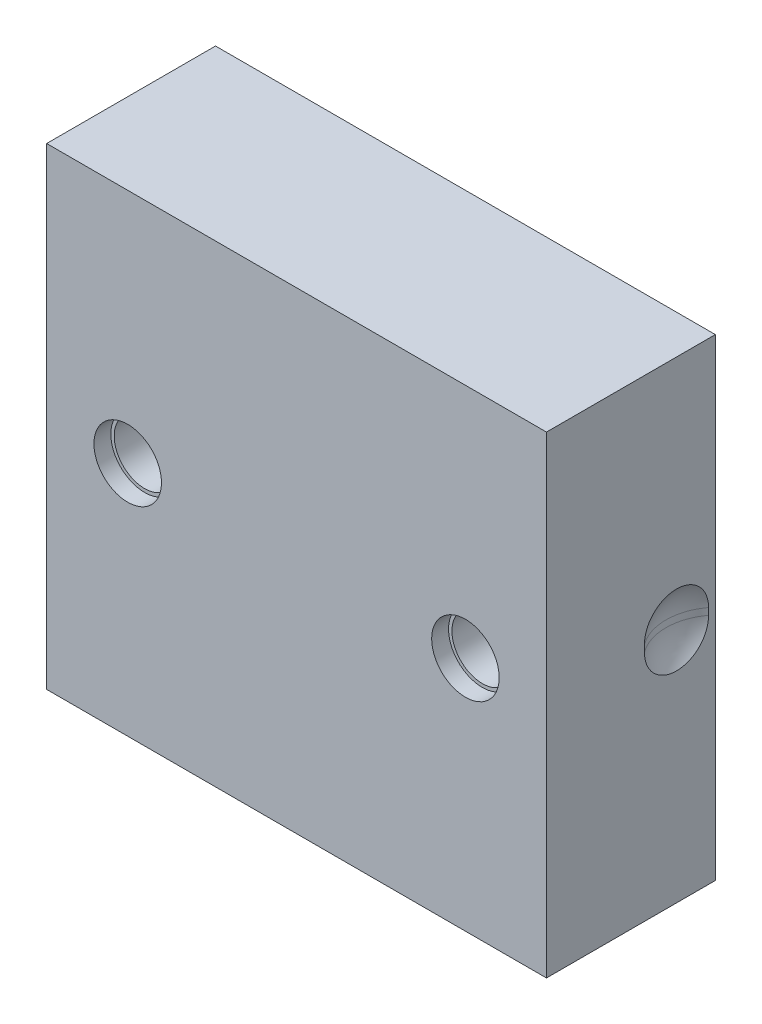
ISO-10303-21;
HEADER;
FILE_DESCRIPTION(('STEP AP214'),'2;1');
FILE_NAME('part.step','',(''),(''),'','','');
FILE_SCHEMA(('AUTOMOTIVE_DESIGN { 1 0 10303 214 1 1 1 1 }'));
ENDSEC;
DATA;
#1=APPLICATION_CONTEXT('core data for automotive mechanical design processes');
#2=APPLICATION_PROTOCOL_DEFINITION('international standard','automotive_design',2000,#1);
#3=PRODUCT_CONTEXT('',#1,'mechanical');
#4=PRODUCT('Part','Part','',(#3));
#5=PRODUCT_RELATED_PRODUCT_CATEGORY('part','',(#4));
#6=PRODUCT_DEFINITION_FORMATION('','',#4);
#7=PRODUCT_DEFINITION_CONTEXT('part definition',#1,'design');
#8=PRODUCT_DEFINITION('design','',#6,#7);
#9=PRODUCT_DEFINITION_SHAPE('','',#8);
#10=(LENGTH_UNIT() NAMED_UNIT(*) SI_UNIT(.MILLI.,.METRE.));
#11=(NAMED_UNIT(*) PLANE_ANGLE_UNIT() SI_UNIT($,.RADIAN.));
#12=(NAMED_UNIT(*) SI_UNIT($,.STERADIAN.) SOLID_ANGLE_UNIT());
#13=UNCERTAINTY_MEASURE_WITH_UNIT(LENGTH_MEASURE(1.E-05),#10,'distance_accuracy_value','');
#14=(GEOMETRIC_REPRESENTATION_CONTEXT(3) GLOBAL_UNCERTAINTY_ASSIGNED_CONTEXT((#13)) GLOBAL_UNIT_ASSIGNED_CONTEXT((#10,
#11,#12)) REPRESENTATION_CONTEXT('',''));
#15=CARTESIAN_POINT('',(0.,0.,0.));
#16=DIRECTION('',(0.,0.,1.));
#17=DIRECTION('',(1.,0.,0.));
#18=AXIS2_PLACEMENT_3D('',#15,#16,#17);
#19=CARTESIAN_POINT('',(-74.5004119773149,24.9995880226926,99.5));
#20=DIRECTION('',(0.,0.,1.));
#21=DIRECTION('',(1.,0.,0.));
#22=AXIS2_PLACEMENT_3D('',#19,#20,#21);
#23=CYLINDRICAL_SURFACE('',#22,9.);
#24=CARTESIAN_POINT('',(-74.5004119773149,24.9995880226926,79.5));
#25=DIRECTION('',(0.,0.,1.));
#26=DIRECTION('',(1.,0.,0.));
#27=AXIS2_PLACEMENT_3D('',#24,#25,#26);
#28=CIRCLE('',#27,9.);
#29=CARTESIAN_POINT('',(-65.5004119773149,24.9995880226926,79.5));
#30=VERTEX_POINT('',#29);
#31=EDGE_CURVE('E284',#30,#30,#28,.F.);
#32=ORIENTED_EDGE('',*,*,#31,.T.);
#33=EDGE_LOOP('',(#32));
#34=FACE_BOUND('',#33,.T.);
#35=CARTESIAN_POINT('',(-74.5004119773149,24.9995880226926,114.5));
#36=DIRECTION('',(0.,0.,1.));
#37=DIRECTION('',(1.,0.,0.));
#38=AXIS2_PLACEMENT_3D('',#35,#36,#37);
#39=CIRCLE('',#38,9.);
#40=CARTESIAN_POINT('',(-65.5004119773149,24.9995880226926,114.5));
#41=VERTEX_POINT('',#40);
#42=EDGE_CURVE('E282',#41,#41,#39,.T.);
#43=ORIENTED_EDGE('',*,*,#42,.T.);
#44=EDGE_LOOP('',(#43));
#45=FACE_BOUND('',#44,.T.);
#46=ADVANCED_FACE('F14',(#34,#45),#23,.F.);
#47=CARTESIAN_POINT('',(-174.500411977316,24.9995880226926,99.5));
#48=DIRECTION('',(0.,0.,1.));
#49=DIRECTION('',(1.,0.,0.));
#50=AXIS2_PLACEMENT_3D('',#47,#48,#49);
#51=CYLINDRICAL_SURFACE('',#50,9.);
#52=CARTESIAN_POINT('',(-174.500411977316,24.9995880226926,79.5));
#53=DIRECTION('',(0.,0.,1.));
#54=DIRECTION('',(1.,0.,0.));
#55=AXIS2_PLACEMENT_3D('',#52,#53,#54);
#56=CIRCLE('',#55,9.);
#57=CARTESIAN_POINT('',(-165.500411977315,24.9995880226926,79.5));
#58=VERTEX_POINT('',#57);
#59=EDGE_CURVE('E18',#58,#58,#56,.F.);
#60=ORIENTED_EDGE('',*,*,#59,.T.);
#61=EDGE_LOOP('',(#60));
#62=FACE_BOUND('',#61,.T.);
#63=CARTESIAN_POINT('',(-174.500411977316,24.9995880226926,114.5));
#64=DIRECTION('',(0.,0.,1.));
#65=DIRECTION('',(1.,0.,0.));
#66=AXIS2_PLACEMENT_3D('',#63,#64,#65);
#67=CIRCLE('',#66,9.);
#68=CARTESIAN_POINT('',(-165.500411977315,24.9995880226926,114.5));
#69=VERTEX_POINT('',#68);
#70=EDGE_CURVE('E279',#69,#69,#67,.T.);
#71=ORIENTED_EDGE('',*,*,#70,.T.);
#72=EDGE_LOOP('',(#71));
#73=FACE_BOUND('',#72,.T.);
#74=ADVANCED_FACE('F291',(#62,#73),#51,.F.);
#75=CARTESIAN_POINT('',(-174.500411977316,24.9995880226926,79.5));
#76=DIRECTION('',(0.,0.,-1.));
#77=DIRECTION('',(-1.,0.,0.));
#78=AXIS2_PLACEMENT_3D('',#75,#76,#77);
#79=PLANE('',#78);
#80=ORIENTED_EDGE('',*,*,#59,.F.);
#81=EDGE_LOOP('',(#80));
#82=FACE_BOUND('',#81,.T.);
#83=CARTESIAN_POINT('',(-174.500411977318,24.9995880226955,79.4999999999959));
#84=DIRECTION('',(0.,0.,1.));
#85=DIRECTION('',(1.,0.,0.));
#86=AXIS2_PLACEMENT_3D('',#83,#84,#85);
#87=CIRCLE('',#86,6.00000000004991);
#88=CARTESIAN_POINT('',(-168.500411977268,24.9995880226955,79.4999999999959));
#89=VERTEX_POINT('',#88);
#90=EDGE_CURVE('E276',#89,#89,#87,.F.);
#91=ORIENTED_EDGE('',*,*,#90,.T.);
#92=EDGE_LOOP('',(#91));
#93=FACE_BOUND('',#92,.T.);
#94=ADVANCED_FACE('F294',(#82,#93),#79,.F.);
#95=CARTESIAN_POINT('',(-74.5004119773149,24.9995880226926,79.5));
#96=DIRECTION('',(0.,0.,-1.));
#97=DIRECTION('',(-1.,0.,0.));
#98=AXIS2_PLACEMENT_3D('',#95,#96,#97);
#99=PLANE('',#98);
#100=ORIENTED_EDGE('',*,*,#31,.F.);
#101=EDGE_LOOP('',(#100));
#102=FACE_BOUND('',#101,.T.);
#103=CARTESIAN_POINT('',(-74.5004119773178,24.9995880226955,79.5000000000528));
#104=DIRECTION('',(0.,0.,1.));
#105=DIRECTION('',(1.,0.,0.));
#106=AXIS2_PLACEMENT_3D('',#103,#104,#105);
#107=CIRCLE('',#106,6.00000000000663);
#108=CARTESIAN_POINT('',(-68.5004119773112,24.9995880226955,79.5000000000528));
#109=VERTEX_POINT('',#108);
#110=EDGE_CURVE('E273',#109,#109,#107,.F.);
#111=ORIENTED_EDGE('',*,*,#110,.T.);
#112=EDGE_LOOP('',(#111));
#113=FACE_BOUND('',#112,.T.);
#114=ADVANCED_FACE('F297',(#102,#113),#99,.F.);
#115=CARTESIAN_POINT('',(-74.5004119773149,24.9995880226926,114.5));
#116=DIRECTION('',(0.,0.,-1.));
#117=DIRECTION('',(-1.,0.,0.));
#118=AXIS2_PLACEMENT_3D('',#115,#116,#117);
#119=PLANE('',#118);
#120=CARTESIAN_POINT('',(-74.5004119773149,24.9995880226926,114.5));
#121=DIRECTION('',(0.,0.,-1.));
#122=DIRECTION('',(-1.,0.,0.));
#123=AXIS2_PLACEMENT_3D('',#120,#121,#122);
#124=CIRCLE('',#123,10.);
#125=CARTESIAN_POINT('',(-84.5004119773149,24.9995880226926,114.5));
#126=VERTEX_POINT('',#125);
#127=EDGE_CURVE('E270',#126,#126,#124,.F.);
#128=ORIENTED_EDGE('',*,*,#127,.T.);
#129=EDGE_LOOP('',(#128));
#130=FACE_BOUND('',#129,.T.);
#131=ORIENTED_EDGE('',*,*,#42,.F.);
#132=EDGE_LOOP('',(#131));
#133=FACE_BOUND('',#132,.T.);
#134=ADVANCED_FACE('F334',(#130,#133),#119,.F.);
#135=CARTESIAN_POINT('',(-174.500411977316,24.9995880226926,114.5));
#136=DIRECTION('',(0.,0.,-1.));
#137=DIRECTION('',(-1.,0.,0.));
#138=AXIS2_PLACEMENT_3D('',#135,#136,#137);
#139=PLANE('',#138);
#140=CARTESIAN_POINT('',(-174.500411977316,24.9995880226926,114.5));
#141=DIRECTION('',(0.,0.,-1.));
#142=DIRECTION('',(-1.,0.,0.));
#143=AXIS2_PLACEMENT_3D('',#140,#141,#142);
#144=CIRCLE('',#143,10.);
#145=CARTESIAN_POINT('',(-184.500411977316,24.9995880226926,114.5));
#146=VERTEX_POINT('',#145);
#147=EDGE_CURVE('E220',#146,#146,#144,.F.);
#148=ORIENTED_EDGE('',*,*,#147,.T.);
#149=EDGE_LOOP('',(#148));
#150=FACE_BOUND('',#149,.T.);
#151=ORIENTED_EDGE('',*,*,#70,.F.);
#152=EDGE_LOOP('',(#151));
#153=FACE_BOUND('',#152,.T.);
#154=ADVANCED_FACE('F305',(#150,#153),#139,.F.);
#155=CARTESIAN_POINT('',(-174.500411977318,24.9995880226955,79.4999999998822));
#156=DIRECTION('',(0.,0.,1.));
#157=DIRECTION('',(1.,0.,0.));
#158=AXIS2_PLACEMENT_3D('',#155,#156,#157);
#159=CONICAL_SURFACE('',#158,5.99999999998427,0.523598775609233);
#160=ORIENTED_EDGE('',*,*,#90,.F.);
#161=EDGE_LOOP('',(#160));
#162=FACE_BOUND('',#161,.T.);
#163=CARTESIAN_POINT('',(-174.500411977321,24.9995880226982,78.2009618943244));
#164=DIRECTION('',(1.81804897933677E-13,-1.75169682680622E-13,-1.));
#165=DIRECTION('',(-1.,0.,-1.81804897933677E-13));
#166=AXIS2_PLACEMENT_3D('',#163,#164,#165);
#167=CIRCLE('',#166,5.25);
#168=CARTESIAN_POINT('',(-179.750411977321,24.9995880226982,78.2009618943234));
#169=VERTEX_POINT('',#168);
#170=EDGE_CURVE('E218',#169,#169,#167,.T.);
#171=ORIENTED_EDGE('',*,*,#170,.T.);
#172=EDGE_LOOP('',(#171));
#173=FACE_BOUND('',#172,.T.);
#174=ADVANCED_FACE('F301',(#162,#173),#159,.F.);
#175=CARTESIAN_POINT('',(-74.5004119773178,24.9995880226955,79.5000000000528));
#176=DIRECTION('',(0.,0.,1.));
#177=DIRECTION('',(1.,0.,0.));
#178=AXIS2_PLACEMENT_3D('',#175,#176,#177);
#179=CONICAL_SURFACE('',#178,6.00000000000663,0.523598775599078);
#180=ORIENTED_EDGE('',*,*,#110,.F.);
#181=EDGE_LOOP('',(#180));
#182=FACE_BOUND('',#181,.T.);
#183=CARTESIAN_POINT('',(-74.5004119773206,24.9995880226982,78.2009618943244));
#184=DIRECTION('',(1.81804897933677E-13,-1.75169682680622E-13,-1.));
#185=DIRECTION('',(-1.,0.,-1.81804897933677E-13));
#186=AXIS2_PLACEMENT_3D('',#183,#184,#185);
#187=CIRCLE('',#186,5.25);
#188=CARTESIAN_POINT('',(-79.7504119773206,24.9995880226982,78.2009618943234));
#189=VERTEX_POINT('',#188);
#190=EDGE_CURVE('E80',#189,#189,#187,.T.);
#191=ORIENTED_EDGE('',*,*,#190,.T.);
#192=EDGE_LOOP('',(#191));
#193=FACE_BOUND('',#192,.T.);
#194=ADVANCED_FACE('F304',(#182,#193),#179,.F.);
#195=CARTESIAN_POINT('',(-74.5004119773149,24.9995880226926,117.));
#196=DIRECTION('',(0.,0.,-1.));
#197=DIRECTION('',(-1.,0.,0.));
#198=AXIS2_PLACEMENT_3D('',#195,#196,#197);
#199=CYLINDRICAL_SURFACE('',#198,10.);
#200=CARTESIAN_POINT('',(-74.5004119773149,24.9995880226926,119.5));
#201=DIRECTION('',(0.,0.,-1.));
#202=DIRECTION('',(-1.,0.,0.));
#203=AXIS2_PLACEMENT_3D('',#200,#201,#202);
#204=CIRCLE('',#203,10.);
#205=CARTESIAN_POINT('',(-84.5004119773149,24.9995880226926,119.5));
#206=VERTEX_POINT('',#205);
#207=EDGE_CURVE('E515',#206,#206,#204,.F.);
#208=ORIENTED_EDGE('',*,*,#207,.T.);
#209=EDGE_LOOP('',(#208));
#210=FACE_BOUND('',#209,.T.);
#211=ORIENTED_EDGE('',*,*,#127,.F.);
#212=EDGE_LOOP('',(#211));
#213=FACE_BOUND('',#212,.T.);
#214=ADVANCED_FACE('F321',(#210,#213),#199,.F.);
#215=CARTESIAN_POINT('',(-174.500411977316,24.9995880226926,117.));
#216=DIRECTION('',(0.,0.,-1.));
#217=DIRECTION('',(-1.,0.,0.));
#218=AXIS2_PLACEMENT_3D('',#215,#216,#217);
#219=CYLINDRICAL_SURFACE('',#218,10.);
#220=CARTESIAN_POINT('',(-174.500411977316,24.9995880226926,119.5));
#221=DIRECTION('',(0.,0.,-1.));
#222=DIRECTION('',(-1.,0.,0.));
#223=AXIS2_PLACEMENT_3D('',#220,#221,#222);
#224=CIRCLE('',#223,10.);
#225=CARTESIAN_POINT('',(-184.500411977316,24.9995880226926,119.5));
#226=VERTEX_POINT('',#225);
#227=EDGE_CURVE('E512',#226,#226,#224,.F.);
#228=ORIENTED_EDGE('',*,*,#227,.T.);
#229=EDGE_LOOP('',(#228));
#230=FACE_BOUND('',#229,.T.);
#231=ORIENTED_EDGE('',*,*,#147,.F.);
#232=EDGE_LOOP('',(#231));
#233=FACE_BOUND('',#232,.T.);
#234=ADVANCED_FACE('F312',(#230,#233),#219,.F.);
#235=CARTESIAN_POINT('',(-174.50041197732,24.9995880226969,71.));
#236=DIRECTION('',(1.81804897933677E-13,-1.75169682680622E-13,-1.));
#237=DIRECTION('',(-1.,0.,-1.81804897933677E-13));
#238=AXIS2_PLACEMENT_3D('',#235,#236,#237);
#239=CYLINDRICAL_SURFACE('',#238,5.25);
#240=CARTESIAN_POINT('',(-174.500411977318,24.9995880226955,62.4999999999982));
#241=DIRECTION('',(1.81804897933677E-13,-1.75169682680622E-13,-1.));
#242=DIRECTION('',(-1.,0.,-1.81804897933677E-13));
#243=AXIS2_PLACEMENT_3D('',#240,#241,#242);
#244=CIRCLE('',#243,5.25);
#245=CARTESIAN_POINT('',(-179.750411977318,24.9995880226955,62.4999999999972));
#246=VERTEX_POINT('',#245);
#247=EDGE_CURVE('E517',#246,#246,#244,.F.);
#248=ORIENTED_EDGE('',*,*,#247,.F.);
#249=EDGE_LOOP('',(#248));
#250=FACE_BOUND('',#249,.T.);
#251=ORIENTED_EDGE('',*,*,#170,.F.);
#252=EDGE_LOOP('',(#251));
#253=FACE_BOUND('',#252,.T.);
#254=ADVANCED_FACE('F309',(#250,#253),#239,.F.);
#255=CARTESIAN_POINT('',(-74.5004119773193,24.9995880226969,71.));
#256=DIRECTION('',(1.81804897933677E-13,-1.75169682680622E-13,-1.));
#257=DIRECTION('',(-1.,0.,-1.81804897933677E-13));
#258=AXIS2_PLACEMENT_3D('',#255,#256,#257);
#259=CYLINDRICAL_SURFACE('',#258,5.25);
#260=CARTESIAN_POINT('',(-74.5004119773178,24.9995880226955,62.4999999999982));
#261=DIRECTION('',(1.81804897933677E-13,-1.75169682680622E-13,-1.));
#262=DIRECTION('',(-1.,0.,-1.81804897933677E-13));
#263=AXIS2_PLACEMENT_3D('',#260,#261,#262);
#264=CIRCLE('',#263,5.25);
#265=CARTESIAN_POINT('',(-79.7504119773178,24.9995880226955,62.4999999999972));
#266=VERTEX_POINT('',#265);
#267=EDGE_CURVE('E89',#266,#266,#264,.F.);
#268=ORIENTED_EDGE('',*,*,#267,.F.);
#269=EDGE_LOOP('',(#268));
#270=FACE_BOUND('',#269,.T.);
#271=ORIENTED_EDGE('',*,*,#190,.F.);
#272=EDGE_LOOP('',(#271));
#273=FACE_BOUND('',#272,.T.);
#274=ADVANCED_FACE('F311',(#270,#273),#259,.F.);
#275=CARTESIAN_POINT('',(-211.250411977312,23.9994564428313,81.));
#276=DIRECTION('',(0.704236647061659,0.304409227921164,0.641393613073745));
#277=DIRECTION('',(-0.637377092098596,0.669025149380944,0.382303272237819));
#278=AXIS2_PLACEMENT_3D('',#275,#276,#277);
#279=SPHERICAL_SURFACE('',#278,15.9);
#280=CARTESIAN_POINT('',(-211.250411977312,23.9994564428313,81.));
#281=DIRECTION('',(0.,-1.,0.));
#282=DIRECTION('',(0.,0.,-1.));
#283=AXIS2_PLACEMENT_3D('',#280,#281,#282);
#284=CIRCLE('',#283,15.9);
#285=CARTESIAN_POINT('',(-198.500411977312,23.9994564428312,90.4998684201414));
#286=VERTEX_POINT('',#285);
#287=CARTESIAN_POINT('',(-198.500411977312,23.9994564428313,71.5001315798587));
#288=VERTEX_POINT('',#287);
#289=EDGE_CURVE('E74',#286,#288,#284,.F.);
#290=ORIENTED_EDGE('',*,*,#289,.T.);
#291=CARTESIAN_POINT('',(-198.500411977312,23.9994564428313,71.5001315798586));
#292=CARTESIAN_POINT('',(-198.500411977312,23.7322696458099,71.5001028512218));
#293=CARTESIAN_POINT('',(-198.500411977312,23.4650869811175,71.5114024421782));
#294=CARTESIAN_POINT('',(-198.500411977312,22.9326331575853,71.5564507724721));
#295=CARTESIAN_POINT('',(-198.500411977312,22.6673619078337,71.5901984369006));
#296=CARTESIAN_POINT('',(-198.500411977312,22.1407933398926,71.6799039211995));
#297=CARTESIAN_POINT('',(-198.500411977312,21.8794933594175,71.7358461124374));
#298=CARTESIAN_POINT('',(-198.500411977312,21.3625354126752,71.8695336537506));
#299=CARTESIAN_POINT('',(-198.500411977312,21.1068773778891,71.9472787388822));
#300=CARTESIAN_POINT('',(-198.500411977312,20.6029003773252,72.1240632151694));
#301=CARTESIAN_POINT('',(-198.500411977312,20.3545848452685,72.2231123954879));
#302=CARTESIAN_POINT('',(-198.500411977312,19.8671762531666,72.4417813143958));
#303=CARTESIAN_POINT('',(-198.500411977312,19.6280833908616,72.5614014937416));
#304=CARTESIAN_POINT('',(-198.500411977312,19.1608739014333,72.8203339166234));
#305=CARTESIAN_POINT('',(-198.500411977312,18.932755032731,72.9596421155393));
#306=CARTESIAN_POINT('',(-198.500411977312,18.4890635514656,73.2569781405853));
#307=CARTESIAN_POINT('',(-198.500411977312,18.2734908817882,73.4150058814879));
#308=CARTESIAN_POINT('',(-198.500411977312,17.8564156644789,73.7486640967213));
#309=CARTESIAN_POINT('',(-198.500411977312,17.654913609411,73.9242951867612));
#310=CARTESIAN_POINT('',(-198.500411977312,17.267424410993,74.2919030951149));
#311=CARTESIAN_POINT('',(-198.500411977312,17.0814369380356,74.4838795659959));
#312=CARTESIAN_POINT('',(-198.500411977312,16.7262650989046,74.8828494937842));
#313=CARTESIAN_POINT('',(-198.500411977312,16.5570834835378,75.0898453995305));
#314=CARTESIAN_POINT('',(-198.500411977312,16.2367609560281,75.5173545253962));
#315=CARTESIAN_POINT('',(-198.500411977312,16.085620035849,75.7378677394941));
#316=CARTESIAN_POINT('',(-198.500411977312,15.8024597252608,76.1908336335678));
#317=CARTESIAN_POINT('',(-198.500411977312,15.670439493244,76.4232857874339));
#318=CARTESIAN_POINT('',(-198.500411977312,15.4264512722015,76.8984858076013));
#319=CARTESIAN_POINT('',(-198.500411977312,15.3144832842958,77.1412336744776));
#320=CARTESIAN_POINT('',(-198.500411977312,15.1114021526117,77.6352833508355));
#321=CARTESIAN_POINT('',(-198.500411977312,15.0202876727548,77.8865846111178));
#322=CARTESIAN_POINT('',(-198.500411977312,14.8595521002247,78.3959693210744));
#323=CARTESIAN_POINT('',(-198.500411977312,14.7899310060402,78.6540527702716));
#324=CARTESIAN_POINT('',(-198.500411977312,14.6726759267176,79.1751725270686));
#325=CARTESIAN_POINT('',(-198.500411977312,14.6250423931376,79.4382089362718));
#326=CARTESIAN_POINT('',(-198.500411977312,14.5521031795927,79.96735948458));
#327=CARTESIAN_POINT('',(-198.500411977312,14.5267975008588,80.2334736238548));
#328=CARTESIAN_POINT('',(-198.500411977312,14.4986935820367,80.7668938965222));
#329=CARTESIAN_POINT('',(-198.500411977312,14.4958958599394,81.034200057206));
#330=CARTESIAN_POINT('',(-198.500411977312,14.5128291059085,81.5680978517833));
#331=CARTESIAN_POINT('',(-198.500411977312,14.5325600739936,81.8346894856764));
#332=CARTESIAN_POINT('',(-198.500411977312,14.594410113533,82.3652602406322));
#333=CARTESIAN_POINT('',(-198.500411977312,14.6365289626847,82.6292393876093));
#334=CARTESIAN_POINT('',(-198.500411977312,14.7428551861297,83.1527111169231));
#335=CARTESIAN_POINT('',(-198.500411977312,14.8070625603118,83.4122036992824));
#336=CARTESIAN_POINT('',(-198.500411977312,14.9571091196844,83.9248566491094));
#337=CARTESIAN_POINT('',(-198.500411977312,15.0429482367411,84.178017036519));
#338=CARTESIAN_POINT('',(-198.500411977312,15.2356481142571,84.6762066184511));
#339=CARTESIAN_POINT('',(-198.500411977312,15.3425088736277,84.9212358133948));
#340=CARTESIAN_POINT('',(-198.500411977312,15.5764941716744,85.4014248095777));
#341=CARTESIAN_POINT('',(-198.500411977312,15.7036190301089,85.6365844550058));
#342=CARTESIAN_POINT('',(-198.500411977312,15.9772303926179,86.0953631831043));
#343=CARTESIAN_POINT('',(-198.500411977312,16.1237173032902,86.3189820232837));
#344=CARTESIAN_POINT('',(-198.500411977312,16.4350000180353,86.7530711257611));
#345=CARTESIAN_POINT('',(-198.500411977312,16.5997947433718,86.9635421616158));
#346=CARTESIAN_POINT('',(-198.500411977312,16.9465282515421,87.3698533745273));
#347=CARTESIAN_POINT('',(-198.500411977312,17.1284670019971,87.5656935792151));
#348=CARTESIAN_POINT('',(-198.500411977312,17.5081699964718,87.9413261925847));
#349=CARTESIAN_POINT('',(-198.500411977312,17.7059321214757,88.1211207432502));
#350=CARTESIAN_POINT('',(-198.500411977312,18.1158975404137,88.4634136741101));
#351=CARTESIAN_POINT('',(-198.500411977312,18.3281008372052,88.6259120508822));
#352=CARTESIAN_POINT('',(-198.500411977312,18.7655134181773,88.9325088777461));
#353=CARTESIAN_POINT('',(-198.500411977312,18.9907270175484,89.0766011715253));
#354=CARTESIAN_POINT('',(-198.500411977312,19.4524871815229,89.3452934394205));
#355=CARTESIAN_POINT('',(-198.500411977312,19.6890334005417,89.4698940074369));
#356=CARTESIAN_POINT('',(-198.500411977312,20.1719364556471,89.6987950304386));
#357=CARTESIAN_POINT('',(-198.500411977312,20.4182994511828,89.8030824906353));
#358=CARTESIAN_POINT('',(-198.500411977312,20.9189357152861,89.990513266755));
#359=CARTESIAN_POINT('',(-198.500411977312,21.1732087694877,90.0736571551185));
#360=CARTESIAN_POINT('',(-198.500411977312,21.6875235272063,90.2181196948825));
#361=CARTESIAN_POINT('',(-198.500411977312,21.9475574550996,90.2794660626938));
#362=CARTESIAN_POINT('',(-198.500411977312,22.4717641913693,90.3800228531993));
#363=CARTESIAN_POINT('',(-198.500411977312,22.7359349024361,90.4192441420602));
#364=CARTESIAN_POINT('',(-198.500411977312,23.1671431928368,90.4648086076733));
#365=CARTESIAN_POINT('',(-198.500411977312,23.333490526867,90.4779644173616));
#366=CARTESIAN_POINT('',(-198.500411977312,23.6663716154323,90.4954880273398));
#367=CARTESIAN_POINT('',(-198.500411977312,23.832904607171,90.4998703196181));
#368=CARTESIAN_POINT('',(-198.500411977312,23.9994564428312,90.4998684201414));
#369=B_SPLINE_CURVE_WITH_KNOTS('',3,(#291,#292,#293,#294,#295,#296,#297,#298,#299,#300,#301,
#302,#303,#304,#305,#306,#307,#308,#309,#310,#311,#312,#313,#314,#315,#316,#317,#318,#319,#320,
#321,#322,#323,#324,#325,#326,#327,#328,#329,#330,#331,#332,#333,#334,#335,#336,#337,#338,#339,
#340,#341,#342,#343,#344,#345,#346,#347,#348,#349,#350,#351,#352,#353,#354,#355,#356,#357,#358,
#359,#360,#361,#362,#363,#364,#365,#366,#367,#368),.UNSPECIFIED.,.F.,.F.,(4,2,2,2,2,2,2,2,2,2,2,
2,2,2,2,2,2,2,2,2,2,2,2,2,2,2,2,2,2,2,2,2,2,2,2,2,2,2,4),(0.,0.801315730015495,1.60259309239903,
2.40330722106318,3.20401162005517,4.00508472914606,4.80617500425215,5.60710094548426,
6.40802324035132,7.20897355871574,8.00990685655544,8.81097103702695,9.6120348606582,
10.4130634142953,11.2140920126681,12.0150692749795,12.8160464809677,13.6170401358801,
14.4180338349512,15.2190459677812,16.0200581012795,16.8210622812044,17.6220664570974,
18.4230681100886,19.2240697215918,20.0250839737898,20.8261150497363,21.6270989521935,
22.4280813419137,23.2289566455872,24.0298321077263,24.8309747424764,25.6320929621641,
26.4337220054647,27.2353293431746,28.0359137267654,28.8361045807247,29.3364921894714,
29.8360525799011),.UNSPECIFIED.);
#370=EDGE_CURVE('E72',#288,#286,#369,.T.);
#371=ORIENTED_EDGE('',*,*,#370,.T.);
#372=EDGE_LOOP('',(#290,#371));
#373=FACE_BOUND('',#372,.T.);
#374=ADVANCED_FACE('F76',(#373),#279,.F.);
#375=CARTESIAN_POINT('',(-211.250411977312,57.6643800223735,81.));
#376=DIRECTION('',(0.,-1.,0.));
#377=DIRECTION('',(0.,0.,-1.));
#378=AXIS2_PLACEMENT_3D('',#375,#376,#377);
#379=CYLINDRICAL_SURFACE('',#378,15.9);
#380=ORIENTED_EDGE('',*,*,#289,.F.);
#381=DIRECTION('',(0.,1.,0.));
#382=VECTOR('',#381,1.);
#383=CARTESIAN_POINT('',(-198.500411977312,24.9995880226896,90.4998684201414));
#384=LINE('',#383,#382);
#385=CARTESIAN_POINT('',(-198.500411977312,25.9997196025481,90.4998684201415));
#386=VERTEX_POINT('',#385);
#387=EDGE_CURVE('E92',#286,#386,#384,.T.);
#388=ORIENTED_EDGE('',*,*,#387,.T.);
#389=CARTESIAN_POINT('',(-211.250411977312,25.9997196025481,81.));
#390=DIRECTION('',(0.,-1.,0.));
#391=DIRECTION('',(0.,0.,-1.));
#392=AXIS2_PLACEMENT_3D('',#389,#390,#391);
#393=CIRCLE('',#392,15.9);
#394=CARTESIAN_POINT('',(-198.500411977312,25.9997196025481,71.5001315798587));
#395=VERTEX_POINT('',#394);
#396=EDGE_CURVE('E79',#386,#395,#393,.F.);
#397=ORIENTED_EDGE('',*,*,#396,.T.);
#398=DIRECTION('',(0.,1.,0.));
#399=VECTOR('',#398,1.);
#400=CARTESIAN_POINT('',(-198.500411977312,24.9995880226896,71.5001315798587));
#401=LINE('',#400,#399);
#402=EDGE_CURVE('E83',#395,#288,#401,.F.);
#403=ORIENTED_EDGE('',*,*,#402,.T.);
#404=EDGE_LOOP('',(#380,#388,#397,#403));
#405=FACE_BOUND('',#404,.T.);
#406=ADVANCED_FACE('F84',(#405),#379,.F.);
#407=CARTESIAN_POINT('',(-211.250411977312,25.9997196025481,81.));
#408=DIRECTION('',(0.704236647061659,0.304409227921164,0.641393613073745));
#409=DIRECTION('',(-0.637377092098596,0.669025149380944,0.382303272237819));
#410=AXIS2_PLACEMENT_3D('',#407,#408,#409);
#411=SPHERICAL_SURFACE('',#410,15.9);
#412=ORIENTED_EDGE('',*,*,#396,.F.);
#413=CARTESIAN_POINT('',(-198.500411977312,25.9997196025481,90.4998684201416));
#414=CARTESIAN_POINT('',(-198.500411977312,26.2669063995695,90.4998971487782));
#415=CARTESIAN_POINT('',(-198.500411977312,26.5340890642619,90.4885975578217));
#416=CARTESIAN_POINT('',(-198.500411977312,27.0665428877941,90.4435492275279));
#417=CARTESIAN_POINT('',(-198.500411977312,27.3318141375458,90.4098015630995));
#418=CARTESIAN_POINT('',(-198.500411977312,27.8583827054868,90.3200960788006));
#419=CARTESIAN_POINT('',(-198.500411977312,28.1196826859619,90.2641538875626));
#420=CARTESIAN_POINT('',(-198.500411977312,28.6366406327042,90.1304663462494));
#421=CARTESIAN_POINT('',(-198.500411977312,28.8922986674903,90.052721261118));
#422=CARTESIAN_POINT('',(-198.500411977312,29.3962756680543,89.8759367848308));
#423=CARTESIAN_POINT('',(-198.500411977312,29.6445912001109,89.7768876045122));
#424=CARTESIAN_POINT('',(-198.500411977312,30.1319997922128,89.5582186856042));
#425=CARTESIAN_POINT('',(-198.500411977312,30.3710926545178,89.4385985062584));
#426=CARTESIAN_POINT('',(-198.500411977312,30.8383021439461,89.1796660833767));
#427=CARTESIAN_POINT('',(-198.500411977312,31.0664210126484,89.0403578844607));
#428=CARTESIAN_POINT('',(-198.500411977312,31.5101124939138,88.7430218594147));
#429=CARTESIAN_POINT('',(-198.500411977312,31.7256851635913,88.5849941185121));
#430=CARTESIAN_POINT('',(-198.500411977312,32.1427603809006,88.2513359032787));
#431=CARTESIAN_POINT('',(-198.500411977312,32.3442624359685,88.0757048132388));
#432=CARTESIAN_POINT('',(-198.500411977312,32.7317516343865,87.708096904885));
#433=CARTESIAN_POINT('',(-198.500411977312,32.9177391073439,87.516120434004));
#434=CARTESIAN_POINT('',(-198.500411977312,33.2729109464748,87.1171505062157));
#435=CARTESIAN_POINT('',(-198.500411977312,33.4420925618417,86.9101546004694));
#436=CARTESIAN_POINT('',(-198.500411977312,33.7624150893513,86.4826454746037));
#437=CARTESIAN_POINT('',(-198.500411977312,33.9135560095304,86.2621322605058));
#438=CARTESIAN_POINT('',(-198.500411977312,34.1967163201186,85.8091663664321));
#439=CARTESIAN_POINT('',(-198.500411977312,34.3287365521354,85.576714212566));
#440=CARTESIAN_POINT('',(-198.500411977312,34.5727247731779,85.1015141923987));
#441=CARTESIAN_POINT('',(-198.500411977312,34.6846927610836,84.8587663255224));
#442=CARTESIAN_POINT('',(-198.500411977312,34.8877738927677,84.3647166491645));
#443=CARTESIAN_POINT('',(-198.500411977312,34.9788883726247,84.1134153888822));
#444=CARTESIAN_POINT('',(-198.500411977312,35.1396239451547,83.6040306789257));
#445=CARTESIAN_POINT('',(-198.500411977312,35.2092450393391,83.3459472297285));
#446=CARTESIAN_POINT('',(-198.500411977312,35.3265001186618,82.8248274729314));
#447=CARTESIAN_POINT('',(-198.500411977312,35.3741336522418,82.5617910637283));
#448=CARTESIAN_POINT('',(-198.500411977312,35.4470728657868,82.0326405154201));
#449=CARTESIAN_POINT('',(-198.500411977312,35.4723785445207,81.7665263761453));
#450=CARTESIAN_POINT('',(-198.500411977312,35.5004824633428,81.2331061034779));
#451=CARTESIAN_POINT('',(-198.500411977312,35.5032801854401,80.9657999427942));
#452=CARTESIAN_POINT('',(-198.500411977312,35.486346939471,80.4319021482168));
#453=CARTESIAN_POINT('',(-198.500411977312,35.4666159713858,80.1653105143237));
#454=CARTESIAN_POINT('',(-198.500411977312,35.4047659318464,79.634739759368));
#455=CARTESIAN_POINT('',(-198.500411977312,35.3626470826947,79.3707606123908));
#456=CARTESIAN_POINT('',(-198.500411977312,35.2563208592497,78.8472888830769));
#457=CARTESIAN_POINT('',(-198.500411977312,35.1921134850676,78.5877963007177));
#458=CARTESIAN_POINT('',(-198.500411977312,35.0420669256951,78.0751433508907));
#459=CARTESIAN_POINT('',(-198.500411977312,34.9562278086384,77.8219829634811));
#460=CARTESIAN_POINT('',(-198.500411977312,34.7635279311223,77.323793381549));
#461=CARTESIAN_POINT('',(-198.500411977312,34.6566671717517,77.0787641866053));
#462=CARTESIAN_POINT('',(-198.500411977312,34.422681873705,76.5985751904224));
#463=CARTESIAN_POINT('',(-198.500411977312,34.2955570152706,76.3634155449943));
#464=CARTESIAN_POINT('',(-198.500411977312,34.0219456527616,75.9046368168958));
#465=CARTESIAN_POINT('',(-198.500411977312,33.8754587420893,75.6810179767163));
#466=CARTESIAN_POINT('',(-198.500411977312,33.5641760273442,75.246928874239));
#467=CARTESIAN_POINT('',(-198.500411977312,33.3993813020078,75.0364578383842));
#468=CARTESIAN_POINT('',(-198.500411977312,33.0526477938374,74.6301466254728));
#469=CARTESIAN_POINT('',(-198.500411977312,32.8707090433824,74.434306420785));
#470=CARTESIAN_POINT('',(-198.500411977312,32.4910060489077,74.0586738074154));
#471=CARTESIAN_POINT('',(-198.500411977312,32.2932439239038,73.8788792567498));
#472=CARTESIAN_POINT('',(-198.500411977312,31.8832785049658,73.53658632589));
#473=CARTESIAN_POINT('',(-198.500411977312,31.6710752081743,73.3740879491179));
#474=CARTESIAN_POINT('',(-198.500411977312,31.2336626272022,73.067491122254));
#475=CARTESIAN_POINT('',(-198.500411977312,31.0084490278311,72.9233988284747));
#476=CARTESIAN_POINT('',(-198.500411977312,30.5466888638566,72.6547065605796));
#477=CARTESIAN_POINT('',(-198.500411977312,30.3101426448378,72.5301059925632));
#478=CARTESIAN_POINT('',(-198.500411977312,29.8272395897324,72.3012049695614));
#479=CARTESIAN_POINT('',(-198.500411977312,29.5808765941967,72.1969175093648));
#480=CARTESIAN_POINT('',(-198.500411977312,29.0802403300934,72.0094867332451));
#481=CARTESIAN_POINT('',(-198.500411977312,28.8259672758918,71.9263428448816));
#482=CARTESIAN_POINT('',(-198.500411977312,28.3116525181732,71.7818803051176));
#483=CARTESIAN_POINT('',(-198.500411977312,28.0516185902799,71.7205339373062));
#484=CARTESIAN_POINT('',(-198.500411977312,27.5274118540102,71.6199771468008));
#485=CARTESIAN_POINT('',(-198.500411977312,27.2632411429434,71.5807558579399));
#486=CARTESIAN_POINT('',(-198.500411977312,26.8320328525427,71.5351913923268));
#487=CARTESIAN_POINT('',(-198.500411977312,26.6656855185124,71.5220355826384));
#488=CARTESIAN_POINT('',(-198.500411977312,26.3328044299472,71.5045119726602));
#489=CARTESIAN_POINT('',(-198.500411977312,26.1662714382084,71.5001296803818));
#490=CARTESIAN_POINT('',(-198.500411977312,25.9997196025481,71.5001315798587));
#491=B_SPLINE_CURVE_WITH_KNOTS('',3,(#413,#414,#415,#416,#417,#418,#419,#420,#421,#422,#423,
#424,#425,#426,#427,#428,#429,#430,#431,#432,#433,#434,#435,#436,#437,#438,#439,#440,#441,#442,
#443,#444,#445,#446,#447,#448,#449,#450,#451,#452,#453,#454,#455,#456,#457,#458,#459,#460,#461,
#462,#463,#464,#465,#466,#467,#468,#469,#470,#471,#472,#473,#474,#475,#476,#477,#478,#479,#480,
#481,#482,#483,#484,#485,#486,#487,#488,#489,#490),.UNSPECIFIED.,.F.,.F.,(4,2,2,2,2,2,2,2,2,2,2,
2,2,2,2,2,2,2,2,2,2,2,2,2,2,2,2,2,2,2,2,2,2,2,2,2,2,2,4),(0.,0.801315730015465,1.60259309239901,
2.40330722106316,3.20401162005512,4.00508472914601,4.80617500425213,5.60710094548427,
6.40802324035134,7.2089735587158,8.0099068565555,8.81097103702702,9.61203486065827,
10.4130634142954,11.2140920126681,12.0150692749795,12.8160464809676,13.61704013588,
14.4180338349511,15.2190459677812,16.0200581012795,16.8210622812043,17.6220664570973,
18.4230681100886,19.2240697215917,20.0250839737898,20.8261150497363,21.6270989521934,
22.4280813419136,23.2289566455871,24.0298321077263,24.8309747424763,25.632092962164,
26.4337220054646,27.2353293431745,28.0359137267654,28.8361045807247,29.3364921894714,
29.8360525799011),.UNSPECIFIED.);
#492=EDGE_CURVE('E94',#386,#395,#491,.T.);
#493=ORIENTED_EDGE('',*,*,#492,.T.);
#494=EDGE_LOOP('',(#412,#493));
#495=FACE_BOUND('',#494,.T.);
#496=ADVANCED_FACE('F156',(#495),#411,.F.);
#497=CARTESIAN_POINT('',(-37.7504119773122,23.9994564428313,81.));
#498=DIRECTION('',(0.704236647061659,0.304409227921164,0.641393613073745));
#499=DIRECTION('',(-0.637377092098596,0.669025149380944,0.382303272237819));
#500=AXIS2_PLACEMENT_3D('',#497,#498,#499);
#501=SPHERICAL_SURFACE('',#500,15.9);
#502=CARTESIAN_POINT('',(-37.7504119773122,23.9994564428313,81.));
#503=DIRECTION('',(0.,1.,0.));
#504=DIRECTION('',(0.,0.,1.));
#505=AXIS2_PLACEMENT_3D('',#502,#503,#504);
#506=CIRCLE('',#505,15.9);
#507=CARTESIAN_POINT('',(-50.5004119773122,23.9994564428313,71.5001315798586));
#508=VERTEX_POINT('',#507);
#509=CARTESIAN_POINT('',(-50.5004119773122,23.9994564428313,90.4998684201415));
#510=VERTEX_POINT('',#509);
#511=EDGE_CURVE('E263',#508,#510,#506,.T.);
#512=ORIENTED_EDGE('',*,*,#511,.T.);
#513=CARTESIAN_POINT('',(-50.5004119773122,23.9994564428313,90.4998684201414));
#514=CARTESIAN_POINT('',(-50.5004119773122,23.7322696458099,90.4998971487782));
#515=CARTESIAN_POINT('',(-50.5004119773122,23.4650869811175,90.4885975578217));
#516=CARTESIAN_POINT('',(-50.5004119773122,22.9326331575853,90.4435492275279));
#517=CARTESIAN_POINT('',(-50.5004119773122,22.6673619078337,90.4098015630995));
#518=CARTESIAN_POINT('',(-50.5004119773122,22.1407933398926,90.3200960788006));
#519=CARTESIAN_POINT('',(-50.5004119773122,21.8794933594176,90.2641538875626));
#520=CARTESIAN_POINT('',(-50.5004119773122,21.3625354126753,90.1304663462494));
#521=CARTESIAN_POINT('',(-50.5004119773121,21.1068773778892,90.0527212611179));
#522=CARTESIAN_POINT('',(-50.5004119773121,20.6029003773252,89.8759367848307));
#523=CARTESIAN_POINT('',(-50.5004119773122,20.3545848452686,89.7768876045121));
#524=CARTESIAN_POINT('',(-50.5004119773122,19.8671762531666,89.5582186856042));
#525=CARTESIAN_POINT('',(-50.5004119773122,19.6280833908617,89.4385985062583));
#526=CARTESIAN_POINT('',(-50.5004119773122,19.1608739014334,89.1796660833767));
#527=CARTESIAN_POINT('',(-50.5004119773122,18.932755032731,89.0403578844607));
#528=CARTESIAN_POINT('',(-50.5004119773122,18.4890635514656,88.7430218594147));
#529=CARTESIAN_POINT('',(-50.5004119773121,18.2734908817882,88.584994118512));
#530=CARTESIAN_POINT('',(-50.5004119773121,17.8564156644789,88.2513359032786));
#531=CARTESIAN_POINT('',(-50.5004119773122,17.654913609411,88.0757048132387));
#532=CARTESIAN_POINT('',(-50.5004119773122,17.2674244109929,87.708096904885));
#533=CARTESIAN_POINT('',(-50.5004119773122,17.0814369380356,87.516120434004));
#534=CARTESIAN_POINT('',(-50.5004119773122,16.7262650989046,87.1171505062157));
#535=CARTESIAN_POINT('',(-50.5004119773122,16.5570834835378,86.9101546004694));
#536=CARTESIAN_POINT('',(-50.5004119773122,16.2367609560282,86.4826454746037));
#537=CARTESIAN_POINT('',(-50.5004119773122,16.0856200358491,86.2621322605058));
#538=CARTESIAN_POINT('',(-50.5004119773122,15.8024597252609,85.8091663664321));
#539=CARTESIAN_POINT('',(-50.5004119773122,15.670439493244,85.576714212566));
#540=CARTESIAN_POINT('',(-50.5004119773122,15.4264512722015,85.1015141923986));
#541=CARTESIAN_POINT('',(-50.5004119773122,15.3144832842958,84.8587663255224));
#542=CARTESIAN_POINT('',(-50.5004119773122,15.1114021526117,84.3647166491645));
#543=CARTESIAN_POINT('',(-50.5004119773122,15.0202876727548,84.1134153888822));
#544=CARTESIAN_POINT('',(-50.5004119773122,14.8595521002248,83.6040306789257));
#545=CARTESIAN_POINT('',(-50.5004119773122,14.7899310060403,83.3459472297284));
#546=CARTESIAN_POINT('',(-50.5004119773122,14.6726759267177,82.8248274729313));
#547=CARTESIAN_POINT('',(-50.5004119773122,14.6250423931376,82.5617910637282));
#548=CARTESIAN_POINT('',(-50.5004119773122,14.5521031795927,82.03264051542));
#549=CARTESIAN_POINT('',(-50.5004119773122,14.5267975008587,81.7665263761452));
#550=CARTESIAN_POINT('',(-50.5004119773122,14.4986935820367,81.2331061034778));
#551=CARTESIAN_POINT('',(-50.5004119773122,14.4958958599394,80.9657999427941));
#552=CARTESIAN_POINT('',(-50.5004119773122,14.5128291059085,80.4319021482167));
#553=CARTESIAN_POINT('',(-50.5004119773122,14.5325600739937,80.1653105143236));
#554=CARTESIAN_POINT('',(-50.5004119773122,14.594410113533,79.6347397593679));
#555=CARTESIAN_POINT('',(-50.5004119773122,14.6365289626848,79.3707606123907));
#556=CARTESIAN_POINT('',(-50.5004119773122,14.7428551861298,78.8472888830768));
#557=CARTESIAN_POINT('',(-50.5004119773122,14.8070625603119,78.5877963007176));
#558=CARTESIAN_POINT('',(-50.5004119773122,14.9571091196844,78.0751433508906));
#559=CARTESIAN_POINT('',(-50.5004119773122,15.0429482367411,77.821982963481));
#560=CARTESIAN_POINT('',(-50.5004119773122,15.2356481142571,77.3237933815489));
#561=CARTESIAN_POINT('',(-50.5004119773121,15.3425088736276,77.0787641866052));
#562=CARTESIAN_POINT('',(-50.5004119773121,15.5764941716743,76.5985751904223));
#563=CARTESIAN_POINT('',(-50.5004119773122,15.7036190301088,76.3634155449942));
#564=CARTESIAN_POINT('',(-50.5004119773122,15.9772303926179,75.9046368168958));
#565=CARTESIAN_POINT('',(-50.5004119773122,16.1237173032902,75.6810179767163));
#566=CARTESIAN_POINT('',(-50.5004119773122,16.4350000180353,75.246928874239));
#567=CARTESIAN_POINT('',(-50.5004119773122,16.5997947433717,75.0364578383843));
#568=CARTESIAN_POINT('',(-50.5004119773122,16.946528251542,74.6301466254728));
#569=CARTESIAN_POINT('',(-50.5004119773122,17.128467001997,74.434306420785));
#570=CARTESIAN_POINT('',(-50.5004119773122,17.5081699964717,74.0586738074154));
#571=CARTESIAN_POINT('',(-50.5004119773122,17.7059321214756,73.8788792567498));
#572=CARTESIAN_POINT('',(-50.5004119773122,18.1158975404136,73.53658632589));
#573=CARTESIAN_POINT('',(-50.5004119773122,18.3281008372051,73.3740879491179));
#574=CARTESIAN_POINT('',(-50.5004119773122,18.7655134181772,73.067491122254));
#575=CARTESIAN_POINT('',(-50.5004119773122,18.9907270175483,72.9233988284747));
#576=CARTESIAN_POINT('',(-50.5004119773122,19.4524871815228,72.6547065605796));
#577=CARTESIAN_POINT('',(-50.5004119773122,19.6890334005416,72.5301059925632));
#578=CARTESIAN_POINT('',(-50.5004119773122,20.171936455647,72.3012049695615));
#579=CARTESIAN_POINT('',(-50.5004119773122,20.4182994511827,72.1969175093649));
#580=CARTESIAN_POINT('',(-50.5004119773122,20.918935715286,72.0094867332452));
#581=CARTESIAN_POINT('',(-50.5004119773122,21.1732087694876,71.9263428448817));
#582=CARTESIAN_POINT('',(-50.5004119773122,21.6875235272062,71.7818803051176));
#583=CARTESIAN_POINT('',(-50.5004119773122,21.9475574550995,71.7205339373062));
#584=CARTESIAN_POINT('',(-50.5004119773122,22.4717641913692,71.6199771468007));
#585=CARTESIAN_POINT('',(-50.5004119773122,22.735934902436,71.5807558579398));
#586=CARTESIAN_POINT('',(-50.5004119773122,23.1671431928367,71.5351913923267));
#587=CARTESIAN_POINT('',(-50.5004119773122,23.333490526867,71.5220355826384));
#588=CARTESIAN_POINT('',(-50.5004119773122,23.6663716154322,71.5045119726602));
#589=CARTESIAN_POINT('',(-50.5004119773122,23.832904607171,71.5001296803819));
#590=CARTESIAN_POINT('',(-50.5004119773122,23.9994564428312,71.5001315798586));
#591=B_SPLINE_CURVE_WITH_KNOTS('',3,(#513,#514,#515,#516,#517,#518,#519,#520,#521,#522,#523,
#524,#525,#526,#527,#528,#529,#530,#531,#532,#533,#534,#535,#536,#537,#538,#539,#540,#541,#542,
#543,#544,#545,#546,#547,#548,#549,#550,#551,#552,#553,#554,#555,#556,#557,#558,#559,#560,#561,
#562,#563,#564,#565,#566,#567,#568,#569,#570,#571,#572,#573,#574,#575,#576,#577,#578,#579,#580,
#581,#582,#583,#584,#585,#586,#587,#588,#589,#590),.UNSPECIFIED.,.F.,.F.,(4,2,2,2,2,2,2,2,2,2,2,
2,2,2,2,2,2,2,2,2,2,2,2,2,2,2,2,2,2,2,2,2,2,2,2,2,2,2,4),(0.,0.801315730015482,1.60259309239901,
2.40330722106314,3.20401162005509,4.00508472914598,4.80617500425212,5.60710094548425,
6.40802324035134,7.20897355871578,8.00990685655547,8.81097103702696,9.61203486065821,
10.4130634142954,11.2140920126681,12.0150692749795,12.8160464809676,13.61704013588,
14.4180338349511,15.2190459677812,16.0200581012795,16.8210622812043,17.6220664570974,
18.4230681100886,19.2240697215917,20.0250839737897,20.8261150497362,21.6270989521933,
22.4280813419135,23.228956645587,24.0298321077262,24.8309747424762,25.6320929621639,
26.4337220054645,27.2353293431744,28.0359137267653,28.8361045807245,29.3364921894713,
29.8360525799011),.UNSPECIFIED.);
#592=EDGE_CURVE('E142',#510,#508,#591,.T.);
#593=ORIENTED_EDGE('',*,*,#592,.T.);
#594=EDGE_LOOP('',(#512,#593));
#595=FACE_BOUND('',#594,.T.);
#596=ADVANCED_FACE('F150',(#595),#501,.F.);
#597=CARTESIAN_POINT('',(-37.7504119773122,57.6643800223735,81.));
#598=DIRECTION('',(0.,1.,0.));
#599=DIRECTION('',(0.,0.,1.));
#600=AXIS2_PLACEMENT_3D('',#597,#598,#599);
#601=CYLINDRICAL_SURFACE('',#600,15.9);
#602=CARTESIAN_POINT('',(-37.7504119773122,25.9997196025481,81.));
#603=DIRECTION('',(0.,1.,0.));
#604=DIRECTION('',(0.,0.,1.));
#605=AXIS2_PLACEMENT_3D('',#602,#603,#604);
#606=CIRCLE('',#605,15.9);
#607=CARTESIAN_POINT('',(-50.5004119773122,25.9997196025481,71.5001315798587));
#608=VERTEX_POINT('',#607);
#609=CARTESIAN_POINT('',(-50.5004119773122,25.9997196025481,90.4998684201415));
#610=VERTEX_POINT('',#609);
#611=EDGE_CURVE('E254',#608,#610,#606,.T.);
#612=ORIENTED_EDGE('',*,*,#611,.T.);
#613=DIRECTION('',(0.,1.,0.));
#614=VECTOR('',#613,1.);
#615=CARTESIAN_POINT('',(-50.5004119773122,24.9995880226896,90.4998684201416));
#616=LINE('',#615,#614);
#617=EDGE_CURVE('E149',#610,#510,#616,.F.);
#618=ORIENTED_EDGE('',*,*,#617,.T.);
#619=ORIENTED_EDGE('',*,*,#511,.F.);
#620=DIRECTION('',(0.,1.,0.));
#621=VECTOR('',#620,1.);
#622=CARTESIAN_POINT('',(-50.5004119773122,24.9995880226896,71.5001315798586));
#623=LINE('',#622,#621);
#624=EDGE_CURVE('E148',#508,#608,#623,.T.);
#625=ORIENTED_EDGE('',*,*,#624,.T.);
#626=EDGE_LOOP('',(#612,#618,#619,#625));
#627=FACE_BOUND('',#626,.T.);
#628=ADVANCED_FACE('F155',(#627),#601,.F.);
#629=CARTESIAN_POINT('',(-37.7504119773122,25.9997196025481,81.));
#630=DIRECTION('',(0.704236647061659,0.304409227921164,0.641393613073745));
#631=DIRECTION('',(-0.637377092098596,0.669025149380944,0.382303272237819));
#632=AXIS2_PLACEMENT_3D('',#629,#630,#631);
#633=SPHERICAL_SURFACE('',#632,15.9);
#634=ORIENTED_EDGE('',*,*,#611,.F.);
#635=CARTESIAN_POINT('',(-50.5004119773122,25.9997196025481,71.5001315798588));
#636=CARTESIAN_POINT('',(-50.5004119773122,26.2669063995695,71.5001028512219));
#637=CARTESIAN_POINT('',(-50.5004119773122,26.534089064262,71.5114024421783));
#638=CARTESIAN_POINT('',(-50.5004119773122,27.0665428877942,71.5564507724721));
#639=CARTESIAN_POINT('',(-50.5004119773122,27.3318141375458,71.5901984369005));
#640=CARTESIAN_POINT('',(-50.5004119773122,27.8583827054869,71.6799039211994));
#641=CARTESIAN_POINT('',(-50.5004119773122,28.119682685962,71.7358461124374));
#642=CARTESIAN_POINT('',(-50.5004119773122,28.6366406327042,71.8695336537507));
#643=CARTESIAN_POINT('',(-50.5004119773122,28.8922986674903,71.9472787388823));
#644=CARTESIAN_POINT('',(-50.5004119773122,29.3962756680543,72.1240632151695));
#645=CARTESIAN_POINT('',(-50.5004119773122,29.644591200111,72.223112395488));
#646=CARTESIAN_POINT('',(-50.5004119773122,30.1319997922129,72.4417813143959));
#647=CARTESIAN_POINT('',(-50.5004119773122,30.3710926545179,72.5614014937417));
#648=CARTESIAN_POINT('',(-50.5004119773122,30.8383021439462,72.8203339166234));
#649=CARTESIAN_POINT('',(-50.5004119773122,31.0664210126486,72.9596421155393));
#650=CARTESIAN_POINT('',(-50.5004119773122,31.5101124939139,73.2569781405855));
#651=CARTESIAN_POINT('',(-50.5004119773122,31.7256851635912,73.4150058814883));
#652=CARTESIAN_POINT('',(-50.5004119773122,32.1427603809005,73.7486640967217));
#653=CARTESIAN_POINT('',(-50.5004119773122,32.3442624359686,73.9242951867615));
#654=CARTESIAN_POINT('',(-50.5004119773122,32.7317516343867,74.2919030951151));
#655=CARTESIAN_POINT('',(-50.5004119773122,32.917739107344,74.4838795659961));
#656=CARTESIAN_POINT('',(-50.5004119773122,33.2729109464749,74.8828494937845));
#657=CARTESIAN_POINT('',(-50.5004119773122,33.4420925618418,75.0898453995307));
#658=CARTESIAN_POINT('',(-50.5004119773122,33.7624150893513,75.5173545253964));
#659=CARTESIAN_POINT('',(-50.5004119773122,33.9135560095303,75.7378677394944));
#660=CARTESIAN_POINT('',(-50.5004119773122,34.1967163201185,76.1908336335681));
#661=CARTESIAN_POINT('',(-50.5004119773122,34.3287365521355,76.4232857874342));
#662=CARTESIAN_POINT('',(-50.5004119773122,34.572724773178,76.8984858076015));
#663=CARTESIAN_POINT('',(-50.5004119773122,34.6846927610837,77.1412336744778));
#664=CARTESIAN_POINT('',(-50.5004119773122,34.8877738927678,77.6352833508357));
#665=CARTESIAN_POINT('',(-50.5004119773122,34.9788883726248,77.886584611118));
#666=CARTESIAN_POINT('',(-50.5004119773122,35.1396239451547,78.3959693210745));
#667=CARTESIAN_POINT('',(-50.5004119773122,35.2092450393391,78.6540527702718));
#668=CARTESIAN_POINT('',(-50.5004119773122,35.3265001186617,79.1751725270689));
#669=CARTESIAN_POINT('',(-50.5004119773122,35.3741336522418,79.438208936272));
#670=CARTESIAN_POINT('',(-50.5004119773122,35.4470728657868,79.9673594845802));
#671=CARTESIAN_POINT('',(-50.5004119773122,35.4723785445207,80.233473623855));
#672=CARTESIAN_POINT('',(-50.5004119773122,35.5004824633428,80.7668938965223));
#673=CARTESIAN_POINT('',(-50.5004119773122,35.50328018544,81.0342000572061));
#674=CARTESIAN_POINT('',(-50.5004119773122,35.4863469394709,81.5680978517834));
#675=CARTESIAN_POINT('',(-50.5004119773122,35.4666159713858,81.8346894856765));
#676=CARTESIAN_POINT('',(-50.5004119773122,35.4047659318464,82.3652602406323));
#677=CARTESIAN_POINT('',(-50.5004119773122,35.3626470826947,82.6292393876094));
#678=CARTESIAN_POINT('',(-50.5004119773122,35.2563208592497,83.1527111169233));
#679=CARTESIAN_POINT('',(-50.5004119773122,35.1921134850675,83.4122036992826));
#680=CARTESIAN_POINT('',(-50.5004119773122,35.042066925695,83.9248566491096));
#681=CARTESIAN_POINT('',(-50.5004119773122,34.9562278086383,84.1780170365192));
#682=CARTESIAN_POINT('',(-50.5004119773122,34.7635279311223,84.6762066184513));
#683=CARTESIAN_POINT('',(-50.5004119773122,34.6566671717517,84.921235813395));
#684=CARTESIAN_POINT('',(-50.5004119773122,34.422681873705,85.4014248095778));
#685=CARTESIAN_POINT('',(-50.5004119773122,34.2955570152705,85.636584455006));
#686=CARTESIAN_POINT('',(-50.5004119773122,34.0219456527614,86.0953631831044));
#687=CARTESIAN_POINT('',(-50.5004119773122,33.8754587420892,86.3189820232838));
#688=CARTESIAN_POINT('',(-50.5004119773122,33.5641760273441,86.7530711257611));
#689=CARTESIAN_POINT('',(-50.5004119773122,33.3993813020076,86.9635421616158));
#690=CARTESIAN_POINT('',(-50.5004119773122,33.0526477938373,87.3698533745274));
#691=CARTESIAN_POINT('',(-50.5004119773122,32.8707090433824,87.5656935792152));
#692=CARTESIAN_POINT('',(-50.5004119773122,32.4910060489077,87.9413261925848));
#693=CARTESIAN_POINT('',(-50.5004119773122,32.2932439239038,88.1211207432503));
#694=CARTESIAN_POINT('',(-50.5004119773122,31.8832785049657,88.4634136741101));
#695=CARTESIAN_POINT('',(-50.5004119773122,31.6710752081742,88.6259120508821));
#696=CARTESIAN_POINT('',(-50.5004119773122,31.2336626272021,88.932508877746));
#697=CARTESIAN_POINT('',(-50.5004119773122,31.0084490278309,89.0766011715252));
#698=CARTESIAN_POINT('',(-50.5004119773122,30.5466888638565,89.3452934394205));
#699=CARTESIAN_POINT('',(-50.5004119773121,30.3101426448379,89.4698940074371));
#700=CARTESIAN_POINT('',(-50.5004119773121,29.8272395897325,89.6987950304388));
#701=CARTESIAN_POINT('',(-50.5004119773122,29.5808765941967,89.8030824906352));
#702=CARTESIAN_POINT('',(-50.5004119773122,29.0802403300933,89.9905132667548));
#703=CARTESIAN_POINT('',(-50.5004119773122,28.8259672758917,90.0736571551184));
#704=CARTESIAN_POINT('',(-50.5004119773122,28.3116525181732,90.2181196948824));
#705=CARTESIAN_POINT('',(-50.5004119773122,28.0516185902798,90.2794660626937));
#706=CARTESIAN_POINT('',(-50.5004119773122,27.5274118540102,90.3800228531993));
#707=CARTESIAN_POINT('',(-50.5004119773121,27.2632411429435,90.4192441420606));
#708=CARTESIAN_POINT('',(-50.5004119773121,26.8320328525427,90.4648086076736));
#709=CARTESIAN_POINT('',(-50.5004119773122,26.6656855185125,90.4779644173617));
#710=CARTESIAN_POINT('',(-50.5004119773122,26.3328044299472,90.4954880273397));
#711=CARTESIAN_POINT('',(-50.5004119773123,26.1662714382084,90.499870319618));
#712=CARTESIAN_POINT('',(-50.5004119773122,25.9997196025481,90.4998684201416));
#713=B_SPLINE_CURVE_WITH_KNOTS('',3,(#635,#636,#637,#638,#639,#640,#641,#642,#643,#644,#645,
#646,#647,#648,#649,#650,#651,#652,#653,#654,#655,#656,#657,#658,#659,#660,#661,#662,#663,#664,
#665,#666,#667,#668,#669,#670,#671,#672,#673,#674,#675,#676,#677,#678,#679,#680,#681,#682,#683,
#684,#685,#686,#687,#688,#689,#690,#691,#692,#693,#694,#695,#696,#697,#698,#699,#700,#701,#702,
#703,#704,#705,#706,#707,#708,#709,#710,#711,#712),.UNSPECIFIED.,.F.,.F.,(4,2,2,2,2,2,2,2,2,2,2,
2,2,2,2,2,2,2,2,2,2,2,2,2,2,2,2,2,2,2,2,2,2,2,2,2,2,2,4),(0.,0.801315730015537,1.60259309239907,
2.40330722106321,3.20401162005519,4.00508472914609,4.80617500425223,5.60710094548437,
6.40802324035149,7.20897355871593,8.00990685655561,8.81097103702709,9.61203486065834,
10.4130634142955,11.2140920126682,12.0150692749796,12.8160464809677,13.6170401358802,
14.4180338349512,15.2190459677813,16.0200581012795,16.8210622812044,17.6220664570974,
18.4230681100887,19.2240697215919,20.0250839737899,20.8261150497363,21.6270989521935,
22.4280813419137,23.2289566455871,24.0298321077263,24.8309747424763,25.6320929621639,
26.4337220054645,27.2353293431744,28.0359137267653,28.8361045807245,29.3364921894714,
29.8360525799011),.UNSPECIFIED.);
#714=EDGE_CURVE('E135',#608,#610,#713,.T.);
#715=ORIENTED_EDGE('',*,*,#714,.T.);
#716=EDGE_LOOP('',(#634,#715));
#717=FACE_BOUND('',#716,.T.);
#718=ADVANCED_FACE('F166',(#717),#633,.F.);
#719=CARTESIAN_POINT('',(-124.500411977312,24.9995880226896,119.5));
#720=DIRECTION('',(0.,0.,-1.));
#721=DIRECTION('',(-1.,0.,0.));
#722=AXIS2_PLACEMENT_3D('',#719,#720,#721);
#723=PLANE('',#722);
#724=DIRECTION('',(1.,0.,0.));
#725=VECTOR('',#724,1.);
#726=CARTESIAN_POINT('',(-124.500411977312,-45.0004119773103,119.5));
#727=LINE('',#726,#725);
#728=CARTESIAN_POINT('',(-198.500411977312,-45.0004119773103,119.5));
#729=VERTEX_POINT('',#728);
#730=CARTESIAN_POINT('',(-50.5004119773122,-45.0004119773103,119.5));
#731=VERTEX_POINT('',#730);
#732=EDGE_CURVE('E227',#729,#731,#727,.T.);
#733=ORIENTED_EDGE('',*,*,#732,.T.);
#734=DIRECTION('',(0.,1.,0.));
#735=VECTOR('',#734,1.);
#736=CARTESIAN_POINT('',(-50.5004119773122,24.9995880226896,119.5));
#737=LINE('',#736,#735);
#738=CARTESIAN_POINT('',(-50.5004119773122,94.9995880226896,119.5));
#739=VERTEX_POINT('',#738);
#740=EDGE_CURVE('E239',#731,#739,#737,.T.);
#741=ORIENTED_EDGE('',*,*,#740,.T.);
#742=DIRECTION('',(1.,0.,0.));
#743=VECTOR('',#742,1.);
#744=CARTESIAN_POINT('',(-124.500411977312,94.9995880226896,119.5));
#745=LINE('',#744,#743);
#746=CARTESIAN_POINT('',(-198.500411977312,94.9995880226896,119.5));
#747=VERTEX_POINT('',#746);
#748=EDGE_CURVE('E245',#739,#747,#745,.F.);
#749=ORIENTED_EDGE('',*,*,#748,.T.);
#750=DIRECTION('',(0.,1.,0.));
#751=VECTOR('',#750,1.);
#752=CARTESIAN_POINT('',(-198.500411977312,24.9995880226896,119.5));
#753=LINE('',#752,#751);
#754=EDGE_CURVE('E165',#747,#729,#753,.F.);
#755=ORIENTED_EDGE('',*,*,#754,.T.);
#756=EDGE_LOOP('',(#733,#741,#749,#755));
#757=FACE_BOUND('',#756,.T.);
#758=ORIENTED_EDGE('',*,*,#227,.F.);
#759=EDGE_LOOP('',(#758));
#760=FACE_BOUND('',#759,.T.);
#761=ORIENTED_EDGE('',*,*,#207,.F.);
#762=EDGE_LOOP('',(#761));
#763=FACE_BOUND('',#762,.T.);
#764=ADVANCED_FACE('F170',(#757,#760,#763),#723,.F.);
#765=CARTESIAN_POINT('',(-166.045797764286,28.0849564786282,62.5));
#766=DIRECTION('',(0.,0.,-1.));
#767=DIRECTION('',(-1.,0.,0.));
#768=AXIS2_PLACEMENT_3D('',#765,#766,#767);
#769=PLANE('',#768);
#770=CARTESIAN_POINT('',(-174.500411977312,24.9995880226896,62.5));
#771=DIRECTION('',(0.,0.,-1.));
#772=DIRECTION('',(-1.,0.,0.));
#773=AXIS2_PLACEMENT_3D('',#770,#771,#772);
#774=CIRCLE('',#773,9.);
#775=CARTESIAN_POINT('',(-183.500411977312,24.9995880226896,62.5));
#776=VERTEX_POINT('',#775);
#777=EDGE_CURVE('E224',#776,#776,#774,.F.);
#778=ORIENTED_EDGE('',*,*,#777,.F.);
#779=EDGE_LOOP('',(#778));
#780=FACE_BOUND('',#779,.T.);
#781=ORIENTED_EDGE('',*,*,#247,.T.);
#782=EDGE_LOOP('',(#781));
#783=FACE_BOUND('',#782,.T.);
#784=ADVANCED_FACE('F173',(#780,#783),#769,.T.);
#785=CARTESIAN_POINT('',(-66.0457977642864,28.0849564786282,62.5));
#786=DIRECTION('',(0.,0.,-1.));
#787=DIRECTION('',(-1.,0.,0.));
#788=AXIS2_PLACEMENT_3D('',#785,#786,#787);
#789=PLANE('',#788);
#790=CARTESIAN_POINT('',(-74.5004119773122,24.9995880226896,62.5));
#791=DIRECTION('',(0.,0.,-1.));
#792=DIRECTION('',(-1.,0.,0.));
#793=AXIS2_PLACEMENT_3D('',#790,#791,#792);
#794=CIRCLE('',#793,9.);
#795=CARTESIAN_POINT('',(-83.5004119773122,24.9995880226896,62.5));
#796=VERTEX_POINT('',#795);
#797=EDGE_CURVE('E215',#796,#796,#794,.F.);
#798=ORIENTED_EDGE('',*,*,#797,.F.);
#799=EDGE_LOOP('',(#798));
#800=FACE_BOUND('',#799,.T.);
#801=ORIENTED_EDGE('',*,*,#267,.T.);
#802=EDGE_LOOP('',(#801));
#803=FACE_BOUND('',#802,.T.);
#804=ADVANCED_FACE('F120',(#800,#803),#789,.T.);
#805=CARTESIAN_POINT('',(-198.500411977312,24.9995880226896,94.5));
#806=DIRECTION('',(1.,0.,0.));
#807=DIRECTION('',(0.,0.,-1.));
#808=AXIS2_PLACEMENT_3D('',#805,#806,#807);
#809=PLANE('',#808);
#810=ORIENTED_EDGE('',*,*,#754,.F.);
#811=DIRECTION('',(0.,0.,-1.));
#812=VECTOR('',#811,1.);
#813=CARTESIAN_POINT('',(-198.500411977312,94.9995880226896,94.5));
#814=LINE('',#813,#812);
#815=CARTESIAN_POINT('',(-198.500411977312,94.9995880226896,69.5));
#816=VERTEX_POINT('',#815);
#817=EDGE_CURVE('E258',#747,#816,#814,.T.);
#818=ORIENTED_EDGE('',*,*,#817,.T.);
#819=DIRECTION('',(0.,1.,0.));
#820=VECTOR('',#819,1.);
#821=CARTESIAN_POINT('',(-198.500411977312,24.9995880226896,69.5));
#822=LINE('',#821,#820);
#823=CARTESIAN_POINT('',(-198.500411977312,-45.0004119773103,69.5));
#824=VERTEX_POINT('',#823);
#825=EDGE_CURVE('E210',#824,#816,#822,.T.);
#826=ORIENTED_EDGE('',*,*,#825,.F.);
#827=DIRECTION('',(0.,0.,1.));
#828=VECTOR('',#827,1.);
#829=CARTESIAN_POINT('',(-198.500411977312,-45.0004119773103,94.5));
#830=LINE('',#829,#828);
#831=EDGE_CURVE('E230',#824,#729,#830,.T.);
#832=ORIENTED_EDGE('',*,*,#831,.T.);
#833=EDGE_LOOP('',(#810,#818,#826,#832));
#834=FACE_BOUND('',#833,.T.);
#835=ORIENTED_EDGE('',*,*,#387,.F.);
#836=ORIENTED_EDGE('',*,*,#370,.F.);
#837=ORIENTED_EDGE('',*,*,#402,.F.);
#838=ORIENTED_EDGE('',*,*,#492,.F.);
#839=EDGE_LOOP('',(#835,#836,#837,#838));
#840=FACE_BOUND('',#839,.T.);
#841=ADVANCED_FACE('F91',(#834,#840),#809,.F.);
#842=CARTESIAN_POINT('',(-124.500411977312,94.9995880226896,94.5));
#843=DIRECTION('',(0.,-1.,0.));
#844=DIRECTION('',(0.,0.,-1.));
#845=AXIS2_PLACEMENT_3D('',#842,#843,#844);
#846=PLANE('',#845);
#847=ORIENTED_EDGE('',*,*,#748,.F.);
#848=DIRECTION('',(0.,0.,1.));
#849=VECTOR('',#848,1.);
#850=CARTESIAN_POINT('',(-50.5004119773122,94.9995880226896,94.5));
#851=LINE('',#850,#849);
#852=CARTESIAN_POINT('',(-50.5004119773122,94.9995880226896,69.5));
#853=VERTEX_POINT('',#852);
#854=EDGE_CURVE('E235',#739,#853,#851,.F.);
#855=ORIENTED_EDGE('',*,*,#854,.T.);
#856=DIRECTION('',(-1.,0.,0.));
#857=VECTOR('',#856,1.);
#858=CARTESIAN_POINT('',(-124.500411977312,94.9995880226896,69.5));
#859=LINE('',#858,#857);
#860=EDGE_CURVE('E206',#816,#853,#859,.F.);
#861=ORIENTED_EDGE('',*,*,#860,.F.);
#862=ORIENTED_EDGE('',*,*,#817,.F.);
#863=EDGE_LOOP('',(#847,#855,#861,#862));
#864=FACE_BOUND('',#863,.T.);
#865=ADVANCED_FACE('F119',(#864),#846,.F.);
#866=CARTESIAN_POINT('',(-50.5004119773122,24.9995880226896,94.5));
#867=DIRECTION('',(-1.,0.,0.));
#868=DIRECTION('',(0.,0.,1.));
#869=AXIS2_PLACEMENT_3D('',#866,#867,#868);
#870=PLANE('',#869);
#871=ORIENTED_EDGE('',*,*,#740,.F.);
#872=DIRECTION('',(0.,0.,1.));
#873=VECTOR('',#872,1.);
#874=CARTESIAN_POINT('',(-50.5004119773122,-45.0004119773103,94.5));
#875=LINE('',#874,#873);
#876=CARTESIAN_POINT('',(-50.5004119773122,-45.0004119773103,69.5));
#877=VERTEX_POINT('',#876);
#878=EDGE_CURVE('E33',#731,#877,#875,.F.);
#879=ORIENTED_EDGE('',*,*,#878,.T.);
#880=DIRECTION('',(0.,1.,0.));
#881=VECTOR('',#880,1.);
#882=CARTESIAN_POINT('',(-50.5004119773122,24.9995880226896,69.5));
#883=LINE('',#882,#881);
#884=EDGE_CURVE('E202',#853,#877,#883,.F.);
#885=ORIENTED_EDGE('',*,*,#884,.F.);
#886=ORIENTED_EDGE('',*,*,#854,.F.);
#887=EDGE_LOOP('',(#871,#879,#885,#886));
#888=FACE_BOUND('',#887,.T.);
#889=ORIENTED_EDGE('',*,*,#624,.F.);
#890=ORIENTED_EDGE('',*,*,#592,.F.);
#891=ORIENTED_EDGE('',*,*,#617,.F.);
#892=ORIENTED_EDGE('',*,*,#714,.F.);
#893=EDGE_LOOP('',(#889,#890,#891,#892));
#894=FACE_BOUND('',#893,.T.);
#895=ADVANCED_FACE('F126',(#888,#894),#870,.F.);
#896=CARTESIAN_POINT('',(-124.500411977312,-45.0004119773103,94.5));
#897=DIRECTION('',(0.,1.,0.));
#898=DIRECTION('',(0.,0.,1.));
#899=AXIS2_PLACEMENT_3D('',#896,#897,#898);
#900=PLANE('',#899);
#901=ORIENTED_EDGE('',*,*,#732,.F.);
#902=ORIENTED_EDGE('',*,*,#831,.F.);
#903=DIRECTION('',(-1.,0.,0.));
#904=VECTOR('',#903,1.);
#905=CARTESIAN_POINT('',(-124.500411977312,-45.0004119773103,69.5));
#906=LINE('',#905,#904);
#907=EDGE_CURVE('E204',#877,#824,#906,.T.);
#908=ORIENTED_EDGE('',*,*,#907,.F.);
#909=ORIENTED_EDGE('',*,*,#878,.F.);
#910=EDGE_LOOP('',(#901,#902,#908,#909));
#911=FACE_BOUND('',#910,.T.);
#912=ADVANCED_FACE('F131',(#911),#900,.F.);
#913=CARTESIAN_POINT('',(-174.500411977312,24.9995880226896,69.5));
#914=DIRECTION('',(0.,0.,-1.));
#915=DIRECTION('',(-1.,0.,0.));
#916=AXIS2_PLACEMENT_3D('',#913,#914,#915);
#917=CYLINDRICAL_SURFACE('',#916,9.);
#918=ORIENTED_EDGE('',*,*,#777,.T.);
#919=EDGE_LOOP('',(#918));
#920=FACE_BOUND('',#919,.T.);
#921=CARTESIAN_POINT('',(-174.500411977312,24.9995880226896,69.4999999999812));
#922=DIRECTION('',(0.,0.,-1.));
#923=DIRECTION('',(-1.,0.,0.));
#924=AXIS2_PLACEMENT_3D('',#921,#922,#923);
#925=CIRCLE('',#924,9.);
#926=CARTESIAN_POINT('',(-183.500411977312,24.9995880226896,69.4999999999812));
#927=VERTEX_POINT('',#926);
#928=EDGE_CURVE('E24',#927,#927,#925,.F.);
#929=ORIENTED_EDGE('',*,*,#928,.F.);
#930=EDGE_LOOP('',(#929));
#931=FACE_BOUND('',#930,.T.);
#932=ADVANCED_FACE('F192',(#920,#931),#917,.T.);
#933=CARTESIAN_POINT('',(-74.5004119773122,24.9995880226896,69.5));
#934=DIRECTION('',(0.,0.,-1.));
#935=DIRECTION('',(-1.,0.,0.));
#936=AXIS2_PLACEMENT_3D('',#933,#934,#935);
#937=CYLINDRICAL_SURFACE('',#936,9.);
#938=ORIENTED_EDGE('',*,*,#797,.T.);
#939=EDGE_LOOP('',(#938));
#940=FACE_BOUND('',#939,.T.);
#941=CARTESIAN_POINT('',(-74.5004119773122,24.9995880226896,69.5));
#942=DIRECTION('',(0.,0.,-1.));
#943=DIRECTION('',(-1.,0.,0.));
#944=AXIS2_PLACEMENT_3D('',#941,#942,#943);
#945=CIRCLE('',#944,9.);
#946=CARTESIAN_POINT('',(-83.5004119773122,24.9995880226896,69.5));
#947=VERTEX_POINT('',#946);
#948=EDGE_CURVE('E9',#947,#947,#945,.F.);
#949=ORIENTED_EDGE('',*,*,#948,.F.);
#950=EDGE_LOOP('',(#949));
#951=FACE_BOUND('',#950,.T.);
#952=ADVANCED_FACE('F186',(#940,#951),#937,.T.);
#953=CARTESIAN_POINT('',(-124.500411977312,24.9995880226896,69.5));
#954=DIRECTION('',(0.,0.,-1.));
#955=DIRECTION('',(-1.,0.,0.));
#956=AXIS2_PLACEMENT_3D('',#953,#954,#955);
#957=PLANE('',#956);
#958=ORIENTED_EDGE('',*,*,#948,.T.);
#959=EDGE_LOOP('',(#958));
#960=FACE_BOUND('',#959,.T.);
#961=ORIENTED_EDGE('',*,*,#928,.T.);
#962=EDGE_LOOP('',(#961));
#963=FACE_BOUND('',#962,.T.);
#964=ORIENTED_EDGE('',*,*,#884,.T.);
#965=ORIENTED_EDGE('',*,*,#907,.T.);
#966=ORIENTED_EDGE('',*,*,#825,.T.);
#967=ORIENTED_EDGE('',*,*,#860,.T.);
#968=EDGE_LOOP('',(#964,#965,#966,#967));
#969=FACE_BOUND('',#968,.T.);
#970=ADVANCED_FACE('F16',(#960,#963,#969),#957,.T.);
#971=CLOSED_SHELL('',(#46,#74,#94,#114,#134,#154,#174,#194,#214,#234,#254,#274,#374,#406,#496,
#596,#628,#718,#764,#784,#804,#841,#865,#895,#912,#932,#952,#970));
#972=MANIFOLD_SOLID_BREP('B1',#971);
#973=ADVANCED_BREP_SHAPE_REPRESENTATION('',(#18,#972),#14);
#974=SHAPE_DEFINITION_REPRESENTATION(#9,#973);
ENDSEC;
END-ISO-10303-21;
